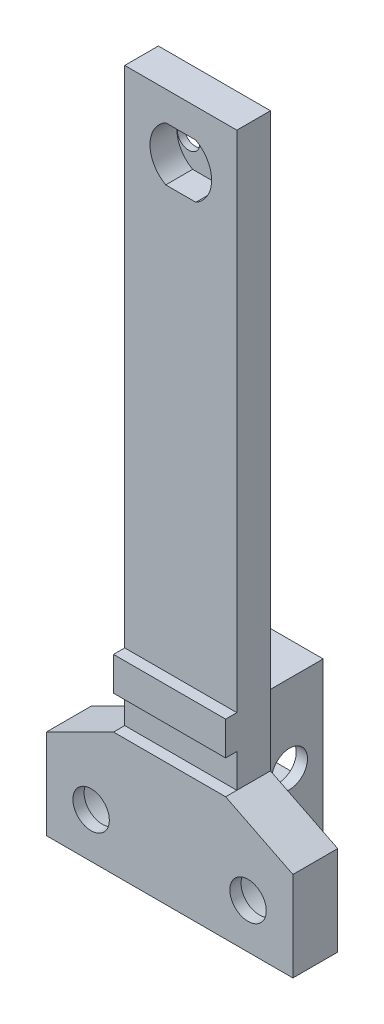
from build123d import *

# Parameters (mm, degrees)
CROQUIS1_W              = 10
CROQUIS1_H              = 60
SALIENTE_EXTRUIR1_DEPTH = 3
CROQUIS2_W              = 10
CROQUIS2_H              = 9
CROQUIS2_H_2            = 3
SALIENTE_EXTRUIR2_DEPTH = 1
CORTAR_EXTRUIR1_DEPTH   = 2.4
CROQUIS4_R              = 1
CORTAR_EXTRUIR2_DEPTH   = 3
SALIENTE_EXTRUIR3_DEPTH = 4
CROQUIS8_W              = 22
CROQUIS8_H              = 2
SALIENTE_EXTRUIR4_DEPTH = 4
CROQUIS6_R              = 3
CORTAR_EXTRUIR3_DEPTH   = 3
CROQUIS7_R              = 1.625
CORTAR_EXTRUIR4_DEPTH   = 4
SKETCH1_W               = 7.4
SKETCH1_H               = 14
SKETCH1_W_2             = 3.2
SKETCH1_H_2             = 6.2
BOSS_EXTRUDE1_DEPTH     = 6
SKETCH2_R               = 1.6
CUT_EXTRUDE1_DEPTH      = 8


with BuildPart() as part:
    # Croquis1 → Saliente-Extruir1 (new body)
    with BuildSketch(Plane.XY):
        Rectangle(CROQUIS1_W, CROQUIS1_H)
    extrude(amount=SALIENTE_EXTRUIR1_DEPTH)

    # Croquis2 → Saliente-Extruir2 (add)
    with BuildSketch(Plane.XY.offset(3)):
        with Locations((0, -25.5)):
            Rectangle(CROQUIS2_W, CROQUIS2_H)
        with Locations((0, -16.5)):
            Rectangle(CROQUIS2_W, CROQUIS2_H_2)
    extrude(amount=SALIENTE_EXTRUIR2_DEPTH)

    # Croquis3 → Cortar-Extruir1 (cut)
    with BuildSketch(Plane.XY.offset(3)):
        with BuildLine():
            Line((-1.342572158, 27.4), (1.342572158, 27.4))
            ThreePointArc((1.342572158, 27.4), (2.75, 25), (1.342572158, 22.6))
            Line((1.342572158, 22.6), (-1.342572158, 22.6))
            ThreePointArc((-1.342572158, 22.6), (-2.75, 25), (-1.342572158, 27.4))
        make_face()
    extrude(amount=-CORTAR_EXTRUIR1_DEPTH, mode=Mode.SUBTRACT)

    # Croquis4 → Cortar-Extruir2 (cut)
    with BuildSketch(Plane.XY.offset(0.6)):
        with Locations((-1.699992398, 24.9)):
            Circle(CROQUIS4_R)
        with Locations((1.7, 24.9)):
            Circle(CROQUIS4_R)
    extrude(amount=-CORTAR_EXTRUIR2_DEPTH, mode=Mode.SUBTRACT)

    # Croquis5 → Saliente-Extruir3 (add)
    with BuildSketch(Plane(origin=(0, 0, 0), x_dir=(-1, 0, 0), z_dir=(0, 0, -1))):
        Polygon((5, -21), (11, -24), (11, -30), (5, -30), align=None)
        Polygon((-5, -21), (-11, -24), (-11, -30), (-5, -30), align=None)
    extrude(amount=-SALIENTE_EXTRUIR3_DEPTH)

    # Croquis8 → Saliente-Extruir4 (add)
    with BuildSketch(Plane(origin=(0, 0, 0), x_dir=(-1, 0, 0), z_dir=(0, 0, -1))):
        with Locations((0, -31)):
            Rectangle(CROQUIS8_W, CROQUIS8_H)
    extrude(amount=-SALIENTE_EXTRUIR4_DEPTH)

    # Croquis6 → Cortar-Extruir3 (cut)
    with BuildSketch(Plane(origin=(0, 0, 0), x_dir=(-1, 0, 0), z_dir=(0, 0, -1))):
        with Locations((7, -28)):
            Circle(CROQUIS6_R)
        with Locations((-7, -28)):
            Circle(CROQUIS6_R)
    extrude(amount=-CORTAR_EXTRUIR3_DEPTH, mode=Mode.SUBTRACT)

    # Croquis7 → Cortar-Extruir4 (cut)
    with BuildSketch(Plane(origin=(0, 0, 3), x_dir=(-1, 0, 0), z_dir=(0, 0, -1))):
        with Locations((7, -28)):
            Circle(CROQUIS7_R)
        with Locations((-7, -28)):
            Circle(CROQUIS7_R)
    extrude(amount=-CORTAR_EXTRUIR4_DEPTH, mode=Mode.SUBTRACT)

    # Sketch1 → Boss-Extrude1 (add)
    with BuildSketch(Plane(origin=(0, 0, 0), x_dir=(-1, 0, 0), z_dir=(0, 0, -1))):
        with Locations((0, -23)):
            Rectangle(SKETCH1_W, SKETCH1_H)
        with Locations((-1.1, -23)):
            Rectangle(SKETCH1_W_2, SKETCH1_H_2, mode=Mode.SUBTRACT)
    extrude(amount=BOSS_EXTRUDE1_DEPTH)

    # Sketch2 → Cut-Extrude1 (cut)
    with BuildSketch(Plane(origin=(3.7, 0, 0), x_dir=(0, 0, -1), z_dir=(1, 0, 0))):
        with Locations((3, -23)):
            Circle(SKETCH2_R)
    extrude(amount=-CUT_EXTRUDE1_DEPTH, mode=Mode.SUBTRACT)


solid = part.part
